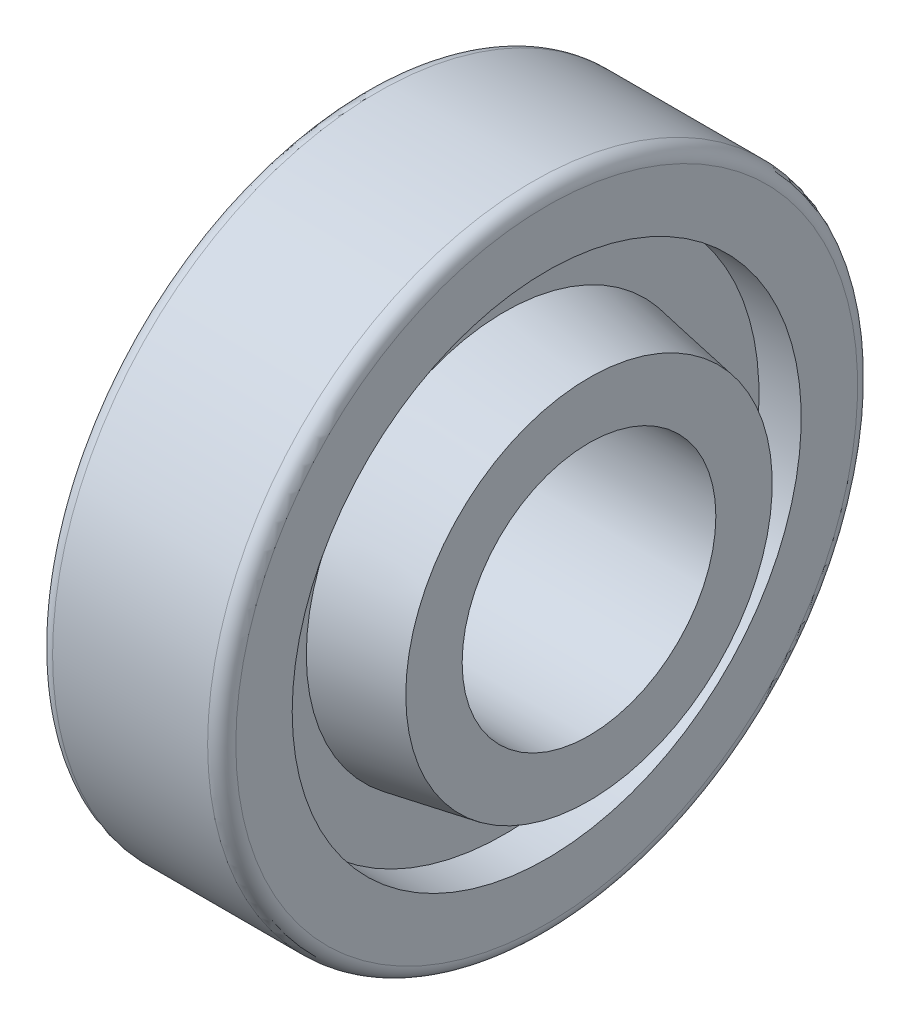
from build123d import *

# Parameters (mm, degrees)
CONG_1_R = 5


with BuildPart() as part:
    # Esquisse1 → R_volution1 (revolve)
    with BuildSketch(Plane.XY, mode=Mode.PRIVATE) as r_volution1_sk:
        Polygon((32.5, 115.289809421), (-32.5, 115.289809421), (-32.5, 90.289809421), (-17.5, 90.289809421), (-17.5, 70.289809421), (-47.5, 65), (-47.5, 45), (47.5, 45), (47.5, 65), (17.5, 70.289809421), (17.5, 90.289809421), (32.5, 90.289809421), align=None)
    revolve(r_volution1_sk.sketch.rotate(Axis((-65.769939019, 0, 0), (1, 0, 0)), 90), axis=Axis((-65.769939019, 0, 0), (1, 0, 0)))

    # Cong_1
    cong_1_edges = [part.edges().sort_by_distance(p)[0] for p in [
        (-32.5, 0, -115.289809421),
        (32.5, 0, -115.289809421),
    ]]
    fillet(cong_1_edges, radius=CONG_1_R)


solid = part.part
